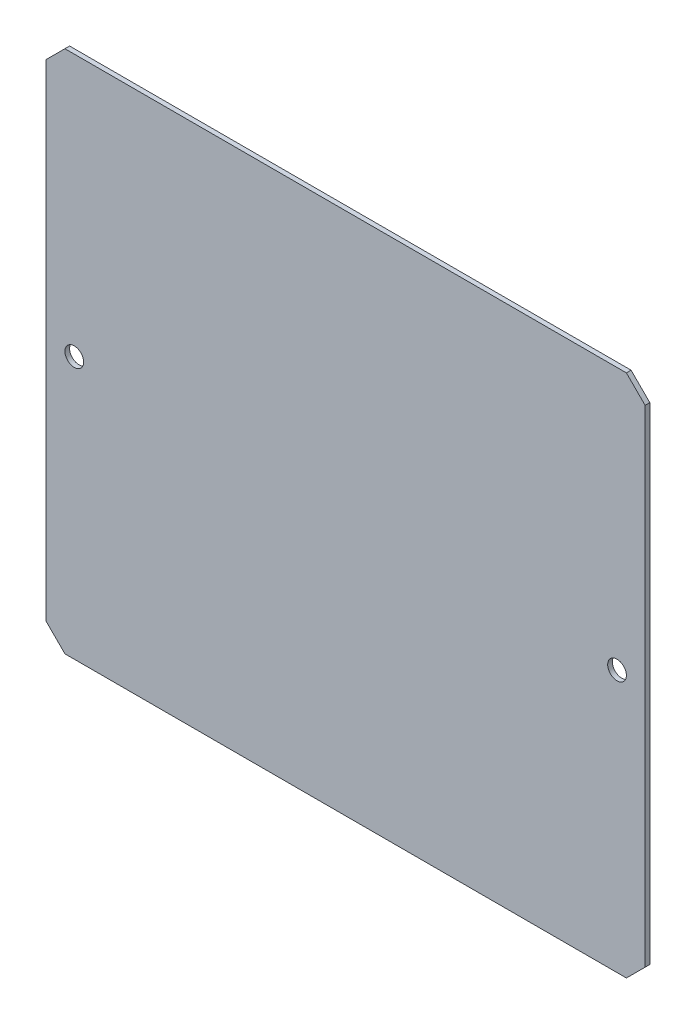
from build123d import *

# Parameters (mm, degrees)
ESQUISSE1_W             = 64
ESQUISSE1_H             = 56
EXTRUSION1_DEPTH        = 0.5
CHANFREIN1_SIZE         = 2
CHANFREIN2_SIZE         = 2
CHANFREIN3_SIZE         = 2
ESQUISSE2_R             = 1
ENL_V_MAT_EXTRU_1_DEPTH = 10


with BuildPart() as part:
    # Esquisse1 → Extrusion1 (new body)
    with BuildSketch(Plane.XY):
        with Locations((-1.099651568, 3.595121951)):
            Rectangle(ESQUISSE1_W, ESQUISSE1_H)
    extrude(amount=EXTRUSION1_DEPTH)

    # Chanfrein1
    chanfrein1_edges = [part.edges().sort_by_distance(p)[0] for p in [
        (-33.099651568, 31.595121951, 0.25),
    ]]
    chamfer(chanfrein1_edges, length=CHANFREIN1_SIZE)

    # Chanfrein2
    chanfrein2_edges = [part.edges().sort_by_distance(p)[0] for p in [
        (30.900348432, 31.595121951, 0.25),
        (30.900348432, -24.404878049, 0.25),
    ]]
    chamfer(chanfrein2_edges, length=CHANFREIN2_SIZE)

    # Chanfrein3
    chanfrein3_edges = [part.edges().sort_by_distance(p)[0] for p in [
        (-33.099651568, -24.404878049, 0.25),
    ]]
    chamfer(chanfrein3_edges, length=CHANFREIN3_SIZE)

    # Esquisse2 → Enl_v. mat.-Extru.1 (cut)
    with BuildSketch(Plane(origin=(0, 0, 0), x_dir=(-1, 0, 0), z_dir=(0, 0, -1))):
        with Locations((-27.900348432, 3.595121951)):
            Circle(ESQUISSE2_R)
        with Locations((30.099651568, 3.595121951)):
            Circle(ESQUISSE2_R)
    extrude(amount=-ENL_V_MAT_EXTRU_1_DEPTH, mode=Mode.SUBTRACT)


solid = part.part
